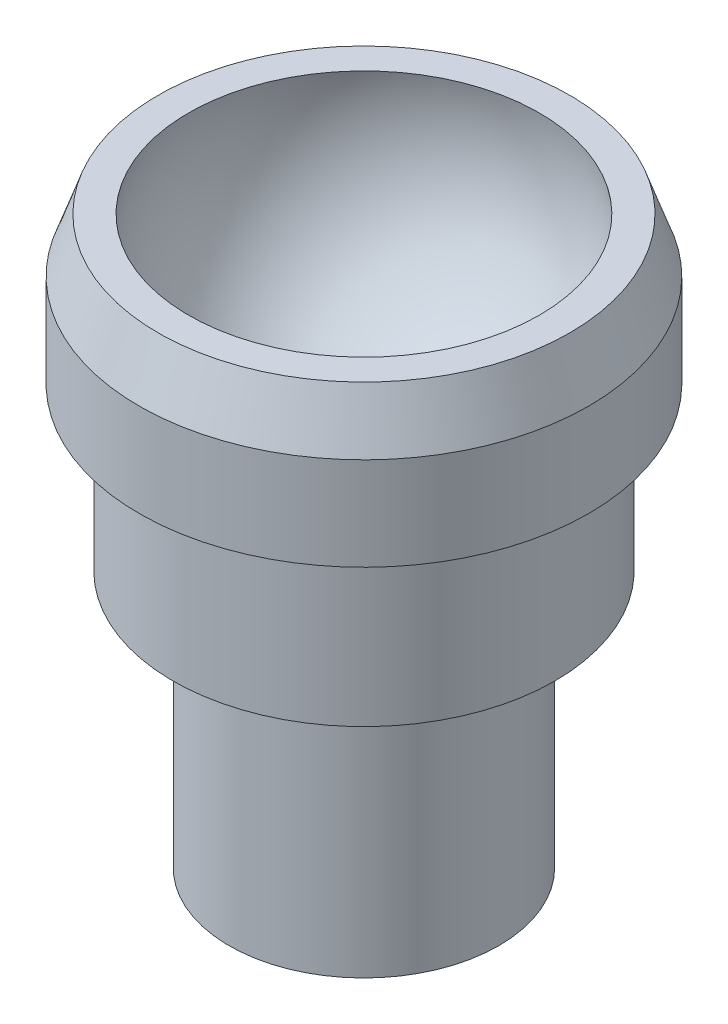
ISO-10303-21;
HEADER;
FILE_DESCRIPTION(('STEP AP214'),'2;1');
FILE_NAME('part.step','',(''),(''),'','','');
FILE_SCHEMA(('AUTOMOTIVE_DESIGN { 1 0 10303 214 1 1 1 1 }'));
ENDSEC;
DATA;
#1=APPLICATION_CONTEXT('core data for automotive mechanical design processes');
#2=APPLICATION_PROTOCOL_DEFINITION('international standard','automotive_design',2000,#1);
#3=PRODUCT_CONTEXT('',#1,'mechanical');
#4=PRODUCT('Part','Part','',(#3));
#5=PRODUCT_RELATED_PRODUCT_CATEGORY('part','',(#4));
#6=PRODUCT_DEFINITION_FORMATION('','',#4);
#7=PRODUCT_DEFINITION_CONTEXT('part definition',#1,'design');
#8=PRODUCT_DEFINITION('design','',#6,#7);
#9=PRODUCT_DEFINITION_SHAPE('','',#8);
#10=(LENGTH_UNIT() NAMED_UNIT(*) SI_UNIT(.MILLI.,.METRE.));
#11=(NAMED_UNIT(*) PLANE_ANGLE_UNIT() SI_UNIT($,.RADIAN.));
#12=(NAMED_UNIT(*) SI_UNIT($,.STERADIAN.) SOLID_ANGLE_UNIT());
#13=UNCERTAINTY_MEASURE_WITH_UNIT(LENGTH_MEASURE(1.E-05),#10,'distance_accuracy_value','');
#14=(GEOMETRIC_REPRESENTATION_CONTEXT(3) GLOBAL_UNCERTAINTY_ASSIGNED_CONTEXT((#13)) GLOBAL_UNIT_ASSIGNED_CONTEXT((#10,
#11,#12)) REPRESENTATION_CONTEXT('',''));
#15=CARTESIAN_POINT('',(0.,0.,0.));
#16=DIRECTION('',(0.,0.,1.));
#17=DIRECTION('',(1.,0.,0.));
#18=AXIS2_PLACEMENT_3D('',#15,#16,#17);
#19=CARTESIAN_POINT('',(0.,11.9636517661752,0.));
#20=DIRECTION('',(0.,-1.,0.));
#21=DIRECTION('',(1.,0.,0.));
#22=AXIS2_PLACEMENT_3D('',#19,#20,#21);
#23=SPHERICAL_SURFACE('',#22,8.);
#24=CARTESIAN_POINT('',(0.,13.74,0.));
#25=DIRECTION('',(0.,-1.,0.));
#26=DIRECTION('',(1.,0.,0.));
#27=AXIS2_PLACEMENT_3D('',#24,#25,#26);
#28=CIRCLE('',#27,7.80029402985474);
#29=CARTESIAN_POINT('',(7.80029402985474,13.74,0.));
#30=VERTEX_POINT('',#29);
#31=EDGE_CURVE('E10',#30,#30,#28,.T.);
#32=ORIENTED_EDGE('',*,*,#31,.F.);
#33=EDGE_LOOP('',(#32));
#34=FACE_BOUND('',#33,.T.);
#35=ADVANCED_FACE('F30',(#34),#23,.F.);
#36=CARTESIAN_POINT('',(9.15781633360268,13.74,0.));
#37=DIRECTION('',(0.,1.,0.));
#38=DIRECTION('',(-1.,0.,0.));
#39=AXIS2_PLACEMENT_3D('',#36,#37,#38);
#40=PLANE('',#39);
#41=ORIENTED_EDGE('',*,*,#31,.T.);
#42=EDGE_LOOP('',(#41));
#43=FACE_BOUND('',#42,.T.);
#44=CARTESIAN_POINT('',(0.,13.74,0.));
#45=DIRECTION('',(0.,-1.,0.));
#46=DIRECTION('',(1.,0.,0.));
#47=AXIS2_PLACEMENT_3D('',#44,#45,#46);
#48=CIRCLE('',#47,9.15781633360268);
#49=CARTESIAN_POINT('',(9.15781633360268,13.74,0.));
#50=VERTEX_POINT('',#49);
#51=EDGE_CURVE('E36',#50,#50,#48,.T.);
#52=ORIENTED_EDGE('',*,*,#51,.F.);
#53=EDGE_LOOP('',(#52));
#54=FACE_BOUND('',#53,.T.);
#55=ADVANCED_FACE('F87',(#43,#54),#40,.T.);
#56=CARTESIAN_POINT('',(0.,11.34,0.));
#57=DIRECTION('',(0.,-1.,0.));
#58=DIRECTION('',(1.,0.,0.));
#59=AXIS2_PLACEMENT_3D('',#56,#57,#58);
#60=CONICAL_SURFACE('',#59,10.,0.337485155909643);
#61=ORIENTED_EDGE('',*,*,#51,.T.);
#62=EDGE_LOOP('',(#61));
#63=FACE_BOUND('',#62,.T.);
#64=CARTESIAN_POINT('',(0.,11.34,0.));
#65=DIRECTION('',(0.,-1.,0.));
#66=DIRECTION('',(1.,0.,0.));
#67=AXIS2_PLACEMENT_3D('',#64,#65,#66);
#68=CIRCLE('',#67,10.);
#69=CARTESIAN_POINT('',(10.,11.34,0.));
#70=VERTEX_POINT('',#69);
#71=EDGE_CURVE('E40',#70,#70,#68,.T.);
#72=ORIENTED_EDGE('',*,*,#71,.F.);
#73=EDGE_LOOP('',(#72));
#74=FACE_BOUND('',#73,.T.);
#75=ADVANCED_FACE('F92',(#63,#74),#60,.T.);
#76=CARTESIAN_POINT('',(0.,13.74,0.));
#77=DIRECTION('',(0.,-1.,0.));
#78=DIRECTION('',(1.,0.,0.));
#79=AXIS2_PLACEMENT_3D('',#76,#77,#78);
#80=CYLINDRICAL_SURFACE('',#79,10.);
#81=ORIENTED_EDGE('',*,*,#71,.T.);
#82=EDGE_LOOP('',(#81));
#83=FACE_BOUND('',#82,.T.);
#84=CARTESIAN_POINT('',(0.,7.2,0.));
#85=DIRECTION('',(0.,-1.,0.));
#86=DIRECTION('',(1.,0.,0.));
#87=AXIS2_PLACEMENT_3D('',#84,#85,#86);
#88=CIRCLE('',#87,10.);
#89=CARTESIAN_POINT('',(10.,7.2,0.));
#90=VERTEX_POINT('',#89);
#91=EDGE_CURVE('E44',#90,#90,#88,.T.);
#92=ORIENTED_EDGE('',*,*,#91,.F.);
#93=EDGE_LOOP('',(#92));
#94=FACE_BOUND('',#93,.T.);
#95=ADVANCED_FACE('F96',(#83,#94),#80,.T.);
#96=CARTESIAN_POINT('',(8.5,7.2,0.));
#97=DIRECTION('',(0.,-1.,0.));
#98=DIRECTION('',(1.,0.,0.));
#99=AXIS2_PLACEMENT_3D('',#96,#97,#98);
#100=PLANE('',#99);
#101=ORIENTED_EDGE('',*,*,#91,.T.);
#102=EDGE_LOOP('',(#101));
#103=FACE_BOUND('',#102,.T.);
#104=CARTESIAN_POINT('',(0.,7.2,0.));
#105=DIRECTION('',(0.,-1.,0.));
#106=DIRECTION('',(1.,0.,0.));
#107=AXIS2_PLACEMENT_3D('',#104,#105,#106);
#108=CIRCLE('',#107,8.5);
#109=CARTESIAN_POINT('',(8.5,7.2,0.));
#110=VERTEX_POINT('',#109);
#111=EDGE_CURVE('E49',#110,#110,#108,.T.);
#112=ORIENTED_EDGE('',*,*,#111,.F.);
#113=EDGE_LOOP('',(#112));
#114=FACE_BOUND('',#113,.T.);
#115=ADVANCED_FACE('F102',(#103,#114),#100,.T.);
#116=CARTESIAN_POINT('',(0.,13.74,0.));
#117=DIRECTION('',(0.,-1.,0.));
#118=DIRECTION('',(1.,0.,0.));
#119=AXIS2_PLACEMENT_3D('',#116,#117,#118);
#120=CYLINDRICAL_SURFACE('',#119,8.5);
#121=ORIENTED_EDGE('',*,*,#111,.T.);
#122=EDGE_LOOP('',(#121));
#123=FACE_BOUND('',#122,.T.);
#124=CARTESIAN_POINT('',(0.,0.,0.));
#125=DIRECTION('',(0.,-1.,0.));
#126=DIRECTION('',(1.,0.,0.));
#127=AXIS2_PLACEMENT_3D('',#124,#125,#126);
#128=CIRCLE('',#127,8.5);
#129=CARTESIAN_POINT('',(8.5,0.,0.));
#130=VERTEX_POINT('',#129);
#131=EDGE_CURVE('E52',#130,#130,#128,.T.);
#132=ORIENTED_EDGE('',*,*,#131,.F.);
#133=EDGE_LOOP('',(#132));
#134=FACE_BOUND('',#133,.T.);
#135=ADVANCED_FACE('F106',(#123,#134),#120,.T.);
#136=CARTESIAN_POINT('',(5.05276838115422,0.,0.));
#137=DIRECTION('',(0.,-1.,0.));
#138=DIRECTION('',(1.,0.,0.));
#139=AXIS2_PLACEMENT_3D('',#136,#137,#138);
#140=PLANE('',#139);
#141=ORIENTED_EDGE('',*,*,#131,.T.);
#142=EDGE_LOOP('',(#141));
#143=FACE_BOUND('',#142,.T.);
#144=CARTESIAN_POINT('',(0.,0.,0.));
#145=DIRECTION('',(0.,-1.,0.));
#146=DIRECTION('',(1.,0.,0.));
#147=AXIS2_PLACEMENT_3D('',#144,#145,#146);
#148=CIRCLE('',#147,5.05276838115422);
#149=CARTESIAN_POINT('',(5.05276838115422,0.,0.));
#150=VERTEX_POINT('',#149);
#151=EDGE_CURVE('E55',#150,#150,#148,.T.);
#152=ORIENTED_EDGE('',*,*,#151,.F.);
#153=EDGE_LOOP('',(#152));
#154=FACE_BOUND('',#153,.T.);
#155=ADVANCED_FACE('F110',(#143,#154),#140,.T.);
#156=CARTESIAN_POINT('',(0.,13.74,0.));
#157=DIRECTION('',(0.,-1.,0.));
#158=DIRECTION('',(1.,0.,0.));
#159=AXIS2_PLACEMENT_3D('',#156,#157,#158);
#160=CYLINDRICAL_SURFACE('',#159,5.05276838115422);
#161=ORIENTED_EDGE('',*,*,#151,.T.);
#162=EDGE_LOOP('',(#161));
#163=FACE_BOUND('',#162,.T.);
#164=CARTESIAN_POINT('',(0.,-1.2,0.));
#165=DIRECTION('',(0.,-1.,0.));
#166=DIRECTION('',(1.,0.,0.));
#167=AXIS2_PLACEMENT_3D('',#164,#165,#166);
#168=CIRCLE('',#167,5.05276838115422);
#169=CARTESIAN_POINT('',(5.05276838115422,-1.2,0.));
#170=VERTEX_POINT('',#169);
#171=EDGE_CURVE('E58',#170,#170,#168,.T.);
#172=ORIENTED_EDGE('',*,*,#171,.F.);
#173=EDGE_LOOP('',(#172));
#174=FACE_BOUND('',#173,.T.);
#175=ADVANCED_FACE('F114',(#163,#174),#160,.T.);
#176=CARTESIAN_POINT('',(0.,-1.74688443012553,0.));
#177=DIRECTION('',(0.,-1.,0.));
#178=DIRECTION('',(1.,0.,0.));
#179=AXIS2_PLACEMENT_3D('',#176,#177,#178);
#180=CONICAL_SURFACE('',#179,6.,1.0471975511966);
#181=ORIENTED_EDGE('',*,*,#171,.T.);
#182=EDGE_LOOP('',(#181));
#183=FACE_BOUND('',#182,.T.);
#184=CARTESIAN_POINT('',(0.,-1.74688443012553,0.));
#185=DIRECTION('',(0.,-1.,0.));
#186=DIRECTION('',(1.,0.,0.));
#187=AXIS2_PLACEMENT_3D('',#184,#185,#186);
#188=CIRCLE('',#187,6.);
#189=CARTESIAN_POINT('',(6.,-1.74688443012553,0.));
#190=VERTEX_POINT('',#189);
#191=EDGE_CURVE('E61',#190,#190,#188,.T.);
#192=ORIENTED_EDGE('',*,*,#191,.F.);
#193=EDGE_LOOP('',(#192));
#194=FACE_BOUND('',#193,.T.);
#195=ADVANCED_FACE('F83',(#183,#194),#180,.T.);
#196=CARTESIAN_POINT('',(0.,13.74,0.));
#197=DIRECTION('',(0.,-1.,0.));
#198=DIRECTION('',(1.,0.,0.));
#199=AXIS2_PLACEMENT_3D('',#196,#197,#198);
#200=CYLINDRICAL_SURFACE('',#199,6.);
#201=ORIENTED_EDGE('',*,*,#191,.T.);
#202=EDGE_LOOP('',(#201));
#203=FACE_BOUND('',#202,.T.);
#204=CARTESIAN_POINT('',(0.,-11.4531155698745,0.));
#205=DIRECTION('',(0.,-1.,0.));
#206=DIRECTION('',(1.,0.,0.));
#207=AXIS2_PLACEMENT_3D('',#204,#205,#206);
#208=CIRCLE('',#207,6.);
#209=CARTESIAN_POINT('',(6.,-11.4531155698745,0.));
#210=VERTEX_POINT('',#209);
#211=EDGE_CURVE('E64',#210,#210,#208,.T.);
#212=ORIENTED_EDGE('',*,*,#211,.F.);
#213=EDGE_LOOP('',(#212));
#214=FACE_BOUND('',#213,.T.);
#215=ADVANCED_FACE('F75',(#203,#214),#200,.T.);
#216=CARTESIAN_POINT('',(0.,-12.,0.));
#217=DIRECTION('',(0.,1.,0.));
#218=DIRECTION('',(-1.,0.,0.));
#219=AXIS2_PLACEMENT_3D('',#216,#217,#218);
#220=CONICAL_SURFACE('',#219,5.05276838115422,1.04719755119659);
#221=ORIENTED_EDGE('',*,*,#211,.T.);
#222=EDGE_LOOP('',(#221));
#223=FACE_BOUND('',#222,.T.);
#224=CARTESIAN_POINT('',(0.,-12.,0.));
#225=DIRECTION('',(0.,-1.,0.));
#226=DIRECTION('',(1.,0.,0.));
#227=AXIS2_PLACEMENT_3D('',#224,#225,#226);
#228=CIRCLE('',#227,5.05276838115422);
#229=CARTESIAN_POINT('',(5.05276838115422,-12.,0.));
#230=VERTEX_POINT('',#229);
#231=EDGE_CURVE('E67',#230,#230,#228,.T.);
#232=ORIENTED_EDGE('',*,*,#231,.F.);
#233=EDGE_LOOP('',(#232));
#234=FACE_BOUND('',#233,.T.);
#235=ADVANCED_FACE('F73',(#223,#234),#220,.T.);
#236=CARTESIAN_POINT('',(0.,-12.,0.));
#237=DIRECTION('',(0.,-1.,0.));
#238=DIRECTION('',(1.,0.,0.));
#239=AXIS2_PLACEMENT_3D('',#236,#237,#238);
#240=PLANE('',#239);
#241=ORIENTED_EDGE('',*,*,#231,.T.);
#242=EDGE_LOOP('',(#241));
#243=FACE_BOUND('',#242,.T.);
#244=ADVANCED_FACE('F71',(#243),#240,.T.);
#245=CLOSED_SHELL('',(#35,#55,#75,#95,#115,#135,#155,#175,#195,#215,#235,#244));
#246=MANIFOLD_SOLID_BREP('B2',#245);
#247=ADVANCED_BREP_SHAPE_REPRESENTATION('',(#18,#246),#14);
#248=SHAPE_DEFINITION_REPRESENTATION(#9,#247);
ENDSEC;
END-ISO-10303-21;
